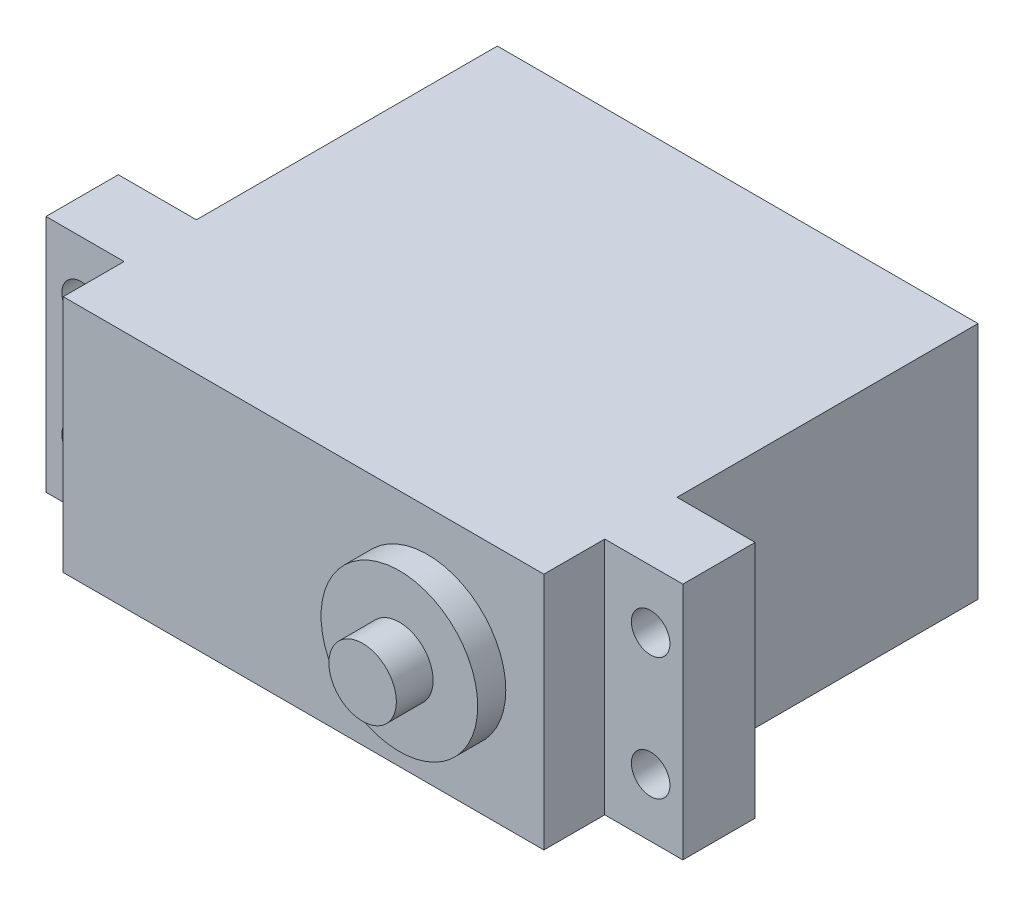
from build123d import *

# Parameters (mm, degrees)
ESQUISSE1_W           = 39.88
ESQUISSE1_H           = 19.82
EXTRUSION1_DEPTH      = 36.02
ESQUISSE2_R           = 6.5
EXTRUSION2_DEPTH      = 2.33
ESQUISSE3_R           = 2.8
EXTRUSION3_DEPTH      = 3.05
EXTRUSION4_DEPTH      = 1.7
EXTRUSION4_DEPTH_BACK = 4.3
ESQUISSE5_W           = 52.84
ESQUISSE5_H           = 19.82
ESQUISSE5_R           = 1.6


with BuildPart() as part:
    # Esquisse1 → Extrusion1 (new body)
    with BuildSketch(Plane.XY):
        with Locations((-10.28, 0)):
            Rectangle(ESQUISSE1_W, ESQUISSE1_H)
    extrude(amount=EXTRUSION1_DEPTH)

    # Esquisse2 → Extrusion2 (add)
    with BuildSketch(Plane.XY.offset(36.02)):
        Circle(ESQUISSE2_R)
    extrude(amount=EXTRUSION2_DEPTH)

    # Esquisse3 → Extrusion3 (add)
    with BuildSketch(Plane.XY.offset(38.35)):
        Circle(ESQUISSE3_R)
    extrude(amount=EXTRUSION3_DEPTH)

    # Esquisse5 → Extrusion4 (add, two sides: drawn at the far end of the back side and taken through both)
    with BuildSketch(Plane(origin=(0, 0, 26.67), x_dir=(-1, 0, 0), z_dir=(0, 0, -1)).offset(-EXTRUSION4_DEPTH_BACK)):
        with Locations((10.28, 0)):
            Rectangle(ESQUISSE5_W, ESQUISSE5_H)
        with Locations((33.79, 5.085)):
            Circle(ESQUISSE5_R, mode=Mode.SUBTRACT)
        with Locations((33.79, -5.085)):
            Circle(ESQUISSE5_R, mode=Mode.SUBTRACT)
        with Locations((-13.47, 5.085)):
            Circle(ESQUISSE5_R, mode=Mode.SUBTRACT)
        with Locations((-13.47, -5.085)):
            Circle(ESQUISSE5_R, mode=Mode.SUBTRACT)
    extrude(amount=EXTRUSION4_DEPTH + EXTRUSION4_DEPTH_BACK)


solid = part.part
